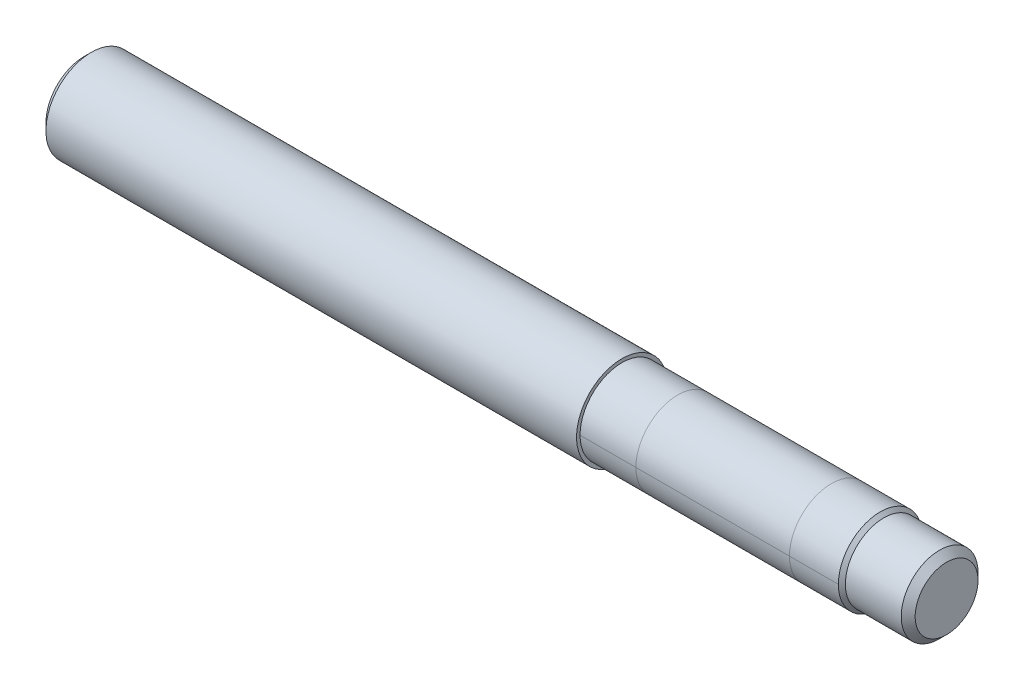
ISO-10303-21;
HEADER;
FILE_DESCRIPTION(('STEP AP214'),'2;1');
FILE_NAME('part.step','',(''),(''),'','','');
FILE_SCHEMA(('AUTOMOTIVE_DESIGN { 1 0 10303 214 1 1 1 1 }'));
ENDSEC;
DATA;
#1=APPLICATION_CONTEXT('core data for automotive mechanical design processes');
#2=APPLICATION_PROTOCOL_DEFINITION('international standard','automotive_design',2000,#1);
#3=PRODUCT_CONTEXT('',#1,'mechanical');
#4=PRODUCT('Part','Part','',(#3));
#5=PRODUCT_RELATED_PRODUCT_CATEGORY('part','',(#4));
#6=PRODUCT_DEFINITION_FORMATION('','',#4);
#7=PRODUCT_DEFINITION_CONTEXT('part definition',#1,'design');
#8=PRODUCT_DEFINITION('design','',#6,#7);
#9=PRODUCT_DEFINITION_SHAPE('','',#8);
#10=(LENGTH_UNIT() NAMED_UNIT(*) SI_UNIT(.MILLI.,.METRE.));
#11=(NAMED_UNIT(*) PLANE_ANGLE_UNIT() SI_UNIT($,.RADIAN.));
#12=(NAMED_UNIT(*) SI_UNIT($,.STERADIAN.) SOLID_ANGLE_UNIT());
#13=UNCERTAINTY_MEASURE_WITH_UNIT(LENGTH_MEASURE(1.E-05),#10,'distance_accuracy_value','');
#14=(GEOMETRIC_REPRESENTATION_CONTEXT(3) GLOBAL_UNCERTAINTY_ASSIGNED_CONTEXT((#13)) GLOBAL_UNIT_ASSIGNED_CONTEXT((#10,
#11,#12)) REPRESENTATION_CONTEXT('',''));
#15=CARTESIAN_POINT('',(0.,0.,0.));
#16=DIRECTION('',(0.,0.,1.));
#17=DIRECTION('',(1.,0.,0.));
#18=AXIS2_PLACEMENT_3D('',#15,#16,#17);
#19=CARTESIAN_POINT('',(77.,0.,0.));
#20=DIRECTION('',(1.,0.,0.));
#21=DIRECTION('',(0.,0.,-1.));
#22=AXIS2_PLACEMENT_3D('',#19,#20,#21);
#23=CYLINDRICAL_SURFACE('',#22,6.);
#24=CARTESIAN_POINT('',(106.9974,0.,0.));
#25=DIRECTION('',(1.,0.,0.));
#26=DIRECTION('',(0.,0.,-1.));
#27=AXIS2_PLACEMENT_3D('',#24,#25,#26);
#28=CIRCLE('',#27,6.);
#29=CARTESIAN_POINT('',(106.9974,0.,-6.));
#30=VERTEX_POINT('',#29);
#31=CARTESIAN_POINT('',(106.9974,-6.,0.));
#32=VERTEX_POINT('',#31);
#33=EDGE_CURVE('E45',#30,#32,#28,.F.);
#34=ORIENTED_EDGE('',*,*,#33,.T.);
#35=CARTESIAN_POINT('',(106.9974,0.,6.));
#36=VERTEX_POINT('',#35);
#37=EDGE_CURVE('E12',#32,#36,#28,.F.);
#38=ORIENTED_EDGE('',*,*,#37,.T.);
#39=DIRECTION('',(1.,0.,0.));
#40=VECTOR('',#39,1.);
#41=CARTESIAN_POINT('',(77.,0.,6.));
#42=LINE('',#41,#40);
#43=CARTESIAN_POINT('',(85.001,0.,6.));
#44=VERTEX_POINT('',#43);
#45=EDGE_CURVE('E98',#36,#44,#42,.F.);
#46=ORIENTED_EDGE('',*,*,#45,.T.);
#47=CARTESIAN_POINT('',(85.001,0.,0.));
#48=DIRECTION('',(1.,0.,0.));
#49=DIRECTION('',(0.,0.,-1.));
#50=AXIS2_PLACEMENT_3D('',#47,#48,#49);
#51=CIRCLE('',#50,6.);
#52=CARTESIAN_POINT('',(85.001,-6.,0.));
#53=VERTEX_POINT('',#52);
#54=EDGE_CURVE('E133',#53,#44,#51,.F.);
#55=ORIENTED_EDGE('',*,*,#54,.F.);
#56=CARTESIAN_POINT('',(85.001,0.,-6.));
#57=VERTEX_POINT('',#56);
#58=EDGE_CURVE('E137',#57,#53,#51,.F.);
#59=ORIENTED_EDGE('',*,*,#58,.F.);
#60=DIRECTION('',(1.,0.,0.));
#61=VECTOR('',#60,1.);
#62=CARTESIAN_POINT('',(77.,0.,-6.));
#63=LINE('',#62,#61);
#64=EDGE_CURVE('E131',#57,#30,#63,.T.);
#65=ORIENTED_EDGE('',*,*,#64,.T.);
#66=EDGE_LOOP('',(#34,#38,#46,#55,#59,#65));
#67=FACE_BOUND('',#66,.T.);
#68=ADVANCED_FACE('F35',(#67),#23,.T.);
#69=ORIENTED_EDGE('',*,*,#45,.F.);
#70=CARTESIAN_POINT('',(106.9974,0.,0.));
#71=DIRECTION('',(1.,0.,0.));
#72=DIRECTION('',(0.,0.,-1.));
#73=AXIS2_PLACEMENT_3D('',#70,#71,#72);
#74=CIRCLE('',#73,6.);
#75=CARTESIAN_POINT('',(106.9974,6.,0.));
#76=VERTEX_POINT('',#75);
#77=EDGE_CURVE('E58',#36,#76,#74,.F.);
#78=ORIENTED_EDGE('',*,*,#77,.T.);
#79=EDGE_CURVE('E39',#76,#30,#74,.F.);
#80=ORIENTED_EDGE('',*,*,#79,.T.);
#81=ORIENTED_EDGE('',*,*,#64,.F.);
#82=CARTESIAN_POINT('',(85.001,0.,0.));
#83=DIRECTION('',(1.,0.,0.));
#84=DIRECTION('',(0.,0.,-1.));
#85=AXIS2_PLACEMENT_3D('',#82,#83,#84);
#86=CIRCLE('',#85,6.);
#87=CARTESIAN_POINT('',(85.001,6.,0.));
#88=VERTEX_POINT('',#87);
#89=EDGE_CURVE('E97',#88,#57,#86,.F.);
#90=ORIENTED_EDGE('',*,*,#89,.F.);
#91=EDGE_CURVE('E140',#44,#88,#86,.F.);
#92=ORIENTED_EDGE('',*,*,#91,.F.);
#93=EDGE_LOOP('',(#69,#78,#80,#81,#90,#92));
#94=FACE_BOUND('',#93,.T.);
#95=ADVANCED_FACE('F193',(#94),#23,.T.);
#96=ORIENTED_EDGE('',*,*,#58,.T.);
#97=ORIENTED_EDGE('',*,*,#54,.T.);
#98=CARTESIAN_POINT('',(77.,0.,6.));
#99=VERTEX_POINT('',#98);
#100=EDGE_CURVE('E100',#44,#99,#42,.F.);
#101=ORIENTED_EDGE('',*,*,#100,.T.);
#102=CARTESIAN_POINT('',(77.,0.,0.));
#103=DIRECTION('',(1.,0.,0.));
#104=DIRECTION('',(0.,0.,-1.));
#105=AXIS2_PLACEMENT_3D('',#102,#103,#104);
#106=CIRCLE('',#105,6.);
#107=CARTESIAN_POINT('',(77.,0.,-6.));
#108=VERTEX_POINT('',#107);
#109=EDGE_CURVE('E109',#99,#108,#106,.T.);
#110=ORIENTED_EDGE('',*,*,#109,.T.);
#111=EDGE_CURVE('E128',#108,#57,#63,.T.);
#112=ORIENTED_EDGE('',*,*,#111,.T.);
#113=EDGE_LOOP('',(#96,#97,#101,#110,#112));
#114=FACE_BOUND('',#113,.T.);
#115=ADVANCED_FACE('F157',(#114),#23,.T.);
#116=ORIENTED_EDGE('',*,*,#100,.F.);
#117=ORIENTED_EDGE('',*,*,#91,.T.);
#118=ORIENTED_EDGE('',*,*,#89,.T.);
#119=ORIENTED_EDGE('',*,*,#111,.F.);
#120=EDGE_CURVE('E111',#108,#99,#106,.T.);
#121=ORIENTED_EDGE('',*,*,#120,.T.);
#122=EDGE_LOOP('',(#116,#117,#118,#119,#121));
#123=FACE_BOUND('',#122,.T.);
#124=ADVANCED_FACE('F173',(#123),#23,.T.);
#125=ORIENTED_EDGE('',*,*,#37,.F.);
#126=ORIENTED_EDGE('',*,*,#33,.F.);
#127=CARTESIAN_POINT('',(114.,0.,-6.));
#128=VERTEX_POINT('',#127);
#129=EDGE_CURVE('E108',#30,#128,#63,.T.);
#130=ORIENTED_EDGE('',*,*,#129,.T.);
#131=CARTESIAN_POINT('',(114.,0.,0.));
#132=DIRECTION('',(-1.,0.,0.));
#133=DIRECTION('',(0.,0.,1.));
#134=AXIS2_PLACEMENT_3D('',#131,#132,#133);
#135=CIRCLE('',#134,6.);
#136=CARTESIAN_POINT('',(114.,0.,6.));
#137=VERTEX_POINT('',#136);
#138=EDGE_CURVE('E104',#137,#128,#135,.F.);
#139=ORIENTED_EDGE('',*,*,#138,.F.);
#140=EDGE_CURVE('E89',#137,#36,#42,.F.);
#141=ORIENTED_EDGE('',*,*,#140,.T.);
#142=EDGE_LOOP('',(#125,#126,#130,#139,#141));
#143=FACE_BOUND('',#142,.T.);
#144=ADVANCED_FACE('F107',(#143),#23,.T.);
#145=CARTESIAN_POINT('',(123.5,0.,0.));
#146=DIRECTION('',(-1.,0.,0.));
#147=DIRECTION('',(0.,0.,1.));
#148=AXIS2_PLACEMENT_3D('',#145,#146,#147);
#149=CYLINDRICAL_SURFACE('',#148,6.5);
#150=CARTESIAN_POINT('',(1.00000000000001,0.,0.));
#151=DIRECTION('',(1.,0.,0.));
#152=DIRECTION('',(0.,0.,-1.));
#153=AXIS2_PLACEMENT_3D('',#150,#151,#152);
#154=CIRCLE('',#153,6.5);
#155=CARTESIAN_POINT('',(1.00000000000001,0.,-6.5));
#156=VERTEX_POINT('',#155);
#157=EDGE_CURVE('E116',#156,#156,#154,.T.);
#158=ORIENTED_EDGE('',*,*,#157,.T.);
#159=EDGE_LOOP('',(#158));
#160=FACE_BOUND('',#159,.T.);
#161=CARTESIAN_POINT('',(77.,0.,0.));
#162=DIRECTION('',(1.,0.,0.));
#163=DIRECTION('',(0.,0.,-1.));
#164=AXIS2_PLACEMENT_3D('',#161,#162,#163);
#165=CIRCLE('',#164,6.5);
#166=CARTESIAN_POINT('',(77.,0.,-6.5));
#167=VERTEX_POINT('',#166);
#168=EDGE_CURVE('E115',#167,#167,#165,.T.);
#169=ORIENTED_EDGE('',*,*,#168,.F.);
#170=EDGE_LOOP('',(#169));
#171=FACE_BOUND('',#170,.T.);
#172=ADVANCED_FACE('F205',(#160,#171),#149,.T.);
#173=CARTESIAN_POINT('',(0.,0.,0.));
#174=DIRECTION('',(1.,0.,0.));
#175=DIRECTION('',(0.,0.,-1.));
#176=AXIS2_PLACEMENT_3D('',#173,#174,#175);
#177=PLANE('',#176);
#178=CARTESIAN_POINT('',(0.,0.,0.));
#179=DIRECTION('',(1.,0.,0.));
#180=DIRECTION('',(0.,0.,-1.));
#181=AXIS2_PLACEMENT_3D('',#178,#179,#180);
#182=CIRCLE('',#181,5.49999999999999);
#183=CARTESIAN_POINT('',(0.,0.,-5.49999999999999));
#184=VERTEX_POINT('',#183);
#185=EDGE_CURVE('E119',#184,#184,#182,.F.);
#186=ORIENTED_EDGE('',*,*,#185,.T.);
#187=EDGE_LOOP('',(#186));
#188=FACE_BOUND('',#187,.T.);
#189=ADVANCED_FACE('F203',(#188),#177,.F.);
#190=CARTESIAN_POINT('',(77.,0.,0.));
#191=DIRECTION('',(1.,0.,0.));
#192=DIRECTION('',(0.,0.,-1.));
#193=AXIS2_PLACEMENT_3D('',#190,#191,#192);
#194=PLANE('',#193);
#195=ORIENTED_EDGE('',*,*,#120,.F.);
#196=ORIENTED_EDGE('',*,*,#109,.F.);
#197=EDGE_LOOP('',(#195,#196));
#198=FACE_BOUND('',#197,.T.);
#199=ORIENTED_EDGE('',*,*,#168,.T.);
#200=EDGE_LOOP('',(#199));
#201=FACE_BOUND('',#200,.T.);
#202=ADVANCED_FACE('F171',(#198,#201),#194,.T.);
#203=ORIENTED_EDGE('',*,*,#77,.F.);
#204=ORIENTED_EDGE('',*,*,#140,.F.);
#205=EDGE_CURVE('E93',#128,#137,#135,.F.);
#206=ORIENTED_EDGE('',*,*,#205,.F.);
#207=ORIENTED_EDGE('',*,*,#129,.F.);
#208=ORIENTED_EDGE('',*,*,#79,.F.);
#209=EDGE_LOOP('',(#203,#204,#206,#207,#208));
#210=FACE_BOUND('',#209,.T.);
#211=ADVANCED_FACE('F91',(#210),#23,.T.);
#212=CARTESIAN_POINT('',(127.965017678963,0.,0.));
#213=DIRECTION('',(1.,0.,0.));
#214=DIRECTION('',(0.,0.,-1.));
#215=AXIS2_PLACEMENT_3D('',#212,#213,#214);
#216=CYLINDRICAL_SURFACE('',#215,5.5);
#217=CARTESIAN_POINT('',(122.5,0.,0.));
#218=DIRECTION('',(1.,0.,0.));
#219=DIRECTION('',(0.,0.,-1.));
#220=AXIS2_PLACEMENT_3D('',#217,#218,#219);
#221=CIRCLE('',#220,5.5);
#222=CARTESIAN_POINT('',(122.5,0.,-5.5));
#223=VERTEX_POINT('',#222);
#224=EDGE_CURVE('E125',#223,#223,#221,.F.);
#225=ORIENTED_EDGE('',*,*,#224,.T.);
#226=EDGE_LOOP('',(#225));
#227=FACE_BOUND('',#226,.T.);
#228=CARTESIAN_POINT('',(114.5,0.,0.));
#229=DIRECTION('',(1.,0.,0.));
#230=DIRECTION('',(0.,0.,-1.));
#231=AXIS2_PLACEMENT_3D('',#228,#229,#230);
#232=CIRCLE('',#231,5.5);
#233=CARTESIAN_POINT('',(114.5,0.,-5.5));
#234=VERTEX_POINT('',#233);
#235=EDGE_CURVE('E105',#234,#234,#232,.T.);
#236=ORIENTED_EDGE('',*,*,#235,.T.);
#237=EDGE_LOOP('',(#236));
#238=FACE_BOUND('',#237,.T.);
#239=ADVANCED_FACE('F179',(#227,#238),#216,.T.);
#240=CARTESIAN_POINT('',(112.600148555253,0.,0.));
#241=DIRECTION('',(-1.,0.,0.));
#242=DIRECTION('',(0.,0.,1.));
#243=AXIS2_PLACEMENT_3D('',#240,#241,#242);
#244=CONICAL_SURFACE('',#243,7.39985144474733,0.785398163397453);
#245=ORIENTED_EDGE('',*,*,#138,.T.);
#246=ORIENTED_EDGE('',*,*,#205,.T.);
#247=EDGE_LOOP('',(#245,#246));
#248=FACE_BOUND('',#247,.T.);
#249=ORIENTED_EDGE('',*,*,#235,.F.);
#250=EDGE_LOOP('',(#249));
#251=FACE_BOUND('',#250,.T.);
#252=ADVANCED_FACE('F102',(#248,#251),#244,.T.);
#253=CARTESIAN_POINT('',(123.5,0.,0.));
#254=DIRECTION('',(1.,0.,0.));
#255=DIRECTION('',(0.,0.,-1.));
#256=AXIS2_PLACEMENT_3D('',#253,#254,#255);
#257=PLANE('',#256);
#258=CARTESIAN_POINT('',(123.5,0.,0.));
#259=DIRECTION('',(1.,0.,0.));
#260=DIRECTION('',(0.,0.,-1.));
#261=AXIS2_PLACEMENT_3D('',#258,#259,#260);
#262=CIRCLE('',#261,4.5);
#263=CARTESIAN_POINT('',(123.5,0.,-4.5));
#264=VERTEX_POINT('',#263);
#265=EDGE_CURVE('E122',#264,#264,#262,.T.);
#266=ORIENTED_EDGE('',*,*,#265,.T.);
#267=EDGE_LOOP('',(#266));
#268=FACE_BOUND('',#267,.T.);
#269=ADVANCED_FACE('F181',(#268),#257,.T.);
#270=CARTESIAN_POINT('',(1.00000000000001,0.,0.));
#271=DIRECTION('',(1.,0.,0.));
#272=DIRECTION('',(0.,0.,-1.));
#273=AXIS2_PLACEMENT_3D('',#270,#271,#272);
#274=CONICAL_SURFACE('',#273,6.5,0.785398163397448);
#275=ORIENTED_EDGE('',*,*,#185,.F.);
#276=EDGE_LOOP('',(#275));
#277=FACE_BOUND('',#276,.T.);
#278=ORIENTED_EDGE('',*,*,#157,.F.);
#279=EDGE_LOOP('',(#278));
#280=FACE_BOUND('',#279,.T.);
#281=ADVANCED_FACE('F187',(#277,#280),#274,.T.);
#282=CARTESIAN_POINT('',(123.5,0.,0.));
#283=DIRECTION('',(-1.,0.,0.));
#284=DIRECTION('',(0.,0.,1.));
#285=AXIS2_PLACEMENT_3D('',#282,#283,#284);
#286=CONICAL_SURFACE('',#285,4.5,0.785398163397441);
#287=ORIENTED_EDGE('',*,*,#224,.F.);
#288=EDGE_LOOP('',(#287));
#289=FACE_BOUND('',#288,.T.);
#290=ORIENTED_EDGE('',*,*,#265,.F.);
#291=EDGE_LOOP('',(#290));
#292=FACE_BOUND('',#291,.T.);
#293=ADVANCED_FACE('F37',(#289,#292),#286,.T.);
#294=CLOSED_SHELL('',(#68,#95,#115,#124,#144,#172,#189,#202,#211,#239,#252,#269,#281,#293));
#295=MANIFOLD_SOLID_BREP('B2',#294);
#296=ADVANCED_BREP_SHAPE_REPRESENTATION('',(#18,#295),#14);
#297=SHAPE_DEFINITION_REPRESENTATION(#9,#296);
ENDSEC;
END-ISO-10303-21;
